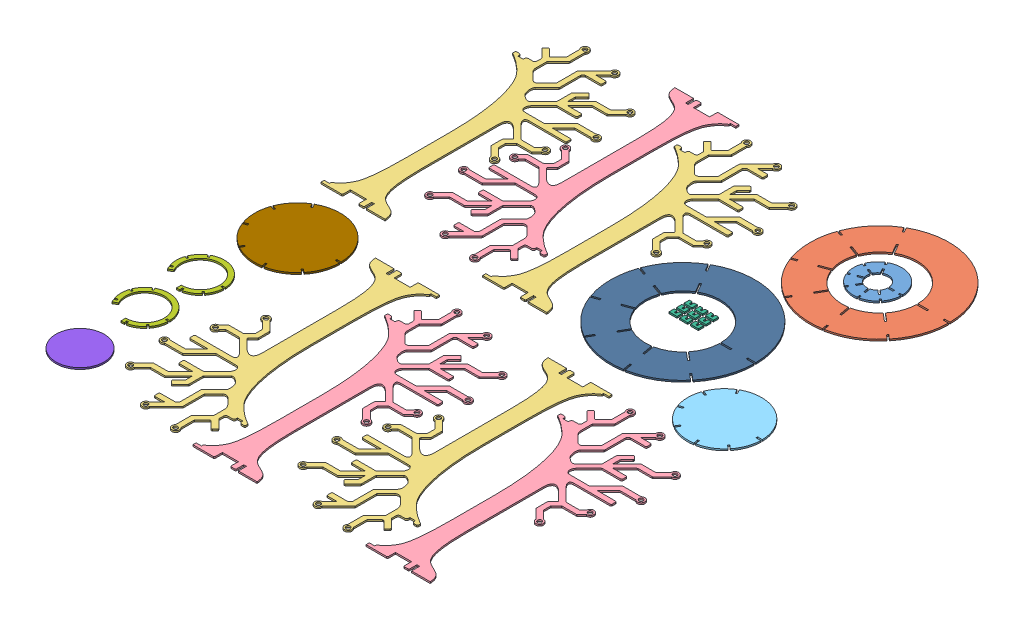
SolidWorks assembly TreePrint.SLDASM, configuration Default (file format 9000). Lengths in mm.
Overall size (4297.09 15 5172.67).
24 component instances, 10 part files, 23 mates.
Components (placement in the parent):
- Tree-Ring-1: Tree-Ring.SLDPRT [Default] at (2145.2995 -381.7094 -2028.0144) size (449.87 15 450)
- Tree-Base-2: Tree-Base.SLDPRT [Default] at (2163.4984 -381.7094 -2029.0173) size (1299.96 15 1300)
- Tree-2: Tree.SLDPRT [Default] at (-1210.2594 -381.7094 -230.2808) size (1107.13 15 2342.63)
- Tree-3: Tree.SLDPRT [Default] at (157.6022 -381.7094 129.1013) x (-1 0 0) z (0 0 -1) size (1107.13 15 2342.63)
- Tree-4: Tree.SLDPRT [Default] at (300.8259 -381.7094 -230.2808) size (1107.13 15 2342.63)
- Tree-5: Tree.SLDPRT [Default] at (1770.7727 -381.7094 129.1013) x (-1 0 0) z (0 0 -1) size (1107.13 15 2342.63)
- Tree-2-1: Tree-2.SLDPRT [Default] at (316.5667 -381.7094 2493.6575) size (1107.13 15 2342.63)
- Tree-2-2: Tree-2.SLDPRT [Default] at (1935.0611 -381.7094 2493.6575) size (1107.13 15 2342.63)
- Tree-2-3: Tree-2.SLDPRT [Default] at (177.69 -381.7094 -2649.5045) x (-1 0 0) z (0 0 -1) size (1107.13 15 2342.63)
- Tree-Base-TopLayer-1: Tree-Base-TopLayer.SLDPRT [Default] at (2541.912 -381.7094 -201.321) size (689.92 15 690)
- Spessore-Test-1: Spessore-Test.SLDPRT [Default] at (1415.8304 -381.7094 -806.9931) size (75 15 50)
- Spessore-Test-2: Spessore-Test.SLDPRT [Default] at (1415.8304 -381.7094 -876.9931) size (75 15 50)
- Spessore-Test-3: Spessore-Test.SLDPRT [Default] at (1515.8304 -381.7094 -806.9931) size (75 15 50)
- Spessore-Test-4: Spessore-Test.SLDPRT [Default] at (1515.8304 -381.7094 -876.9931) size (75 15 50)
- Spessore-Test-5: Spessore-Test.SLDPRT [Default] at (1615.8304 -381.7094 -806.9931) size (75 15 50)
- Spessore-Test-6: Spessore-Test.SLDPRT [Default] at (1615.8304 -381.7094 -876.9931) size (75 15 50)
- Spessore-Test-11: Spessore-Test.SLDPRT [Default] at (1415.8304 -381.7094 -946.9931) size (75 15 50)
- Spessore-Test-12: Spessore-Test.SLDPRT [Default] at (1515.8304 -381.7094 -946.9931) size (75 15 50)
- Spessore-Test-13: Spessore-Test.SLDPRT [Default] at (1615.8304 -381.7094 -946.9931) size (75 15 50)
- Tree-Ring-Layer1-1: Tree-Ring-Layer1.SLDPRT [Default] at (-1072.6547 -381.7094 1603.0356) size (449.87 15 450)
- Tree-Ring-Layer1-2: Tree-Ring-Layer1.SLDPRT [Default] at (-1079.963 -381.7094 1076.8425) size (449.87 15 450)
- Tree-Ring-Layer2-1: Tree-Ring-Layer2.SLDPRT [Default] at (-1043.4843 -381.7094 2238.8522) size (450 15 450)
- Tree-Base-TopLayer-Extended-1: Tree-Base-TopLayer-Extended.SLDPRT [Default] at (-919.9753 -381.7094 329.3469) size (799.93 15 800)
- Tree-Base-Extended-1: Tree-Base-Extended.SLDPRT [Default] at (1558.2691 -381.7094 -794.0663) size (1349.96 15 1350)
Mates (geometry in assembly coordinates):
- Coincident1: coincident aligned: plane of Tree-3 through (157.6022 -366.7094 129.1013) normal (0 1 0); plane of Tree-2 through (-1210.2594 -366.7094 -230.2808) normal (0 1 0)
- Coincident2: coincident aligned: plane of Tree-3 through (157.6022 -366.7094 129.1013) normal (0 1 0); plane of Tree-4 through (300.8259 -366.7094 -230.2808) normal (0 1 0)
- Coincident3: coincident aligned: plane of Tree-3 through (157.6022 -366.7094 129.1013) normal (0 1 0); plane of Tree-5 through (1770.7727 -366.7094 129.1013) normal (0 1 0)
- Coincident4: coincident aligned: plane of Tree-3 through (157.6022 -366.7094 129.1013) normal (0 1 0); plane of Tree-Base-2 through (2163.4984 -366.7094 -2029.0173) normal (0 1 0)
- Coincident5: coincident aligned: plane of Tree-3 through (157.6022 -366.7094 129.1013) normal (0 1 0); plane of Tree-Ring-1 through (2145.2995 -366.7094 -2028.0144) normal (0 1 0)
- Coincident7: coincident aligned: line of Tree-3 through (207.6022 -366.7094 129.1013) axis (-1 0 0); line of Tree-5 through (1820.7727 -366.7094 129.1013) axis (-1 0 0)
- Parallel2: parallel anti-aligned: line of Tree-4 through (250.8259 -366.7094 -230.2808) axis (1 0 0); line of Tree-5 through (1820.7727 -366.7094 129.1013) axis (-1 0 0)
- Coincident9: coincident aligned: line of Tree-2 through (-1260.2594 -366.7094 -230.2808) axis (1 0 0); line of Tree-4 through (250.8259 -366.7094 -230.2808) axis (1 0 0)
- Parallel3: parallel aligned: line of Tree-Base-2 through (2763.4984 -366.7094 -2021.5173) axis (1 0 0); line of Tree-2 through (-1260.2594 -366.7094 -230.2808) axis (1 0 0)
- Parallel4: parallel aligned: line of Tree-Ring-1 through (2345.2995 -366.7094 -2020.5144) axis (1 0 0); line of Tree-2 through (-1260.2594 -366.7094 -230.2808) axis (1 0 0)
- Coincident11: coincident aligned: plane of Tree-Ring-1 through (2145.2995 -366.7094 -2028.0144) normal (0 1 0); plane of Tree-2-1 through (316.5667 -366.7094 2493.6575) normal (0 1 0)
- Parallel6: parallel anti-aligned: plane of Tree-Base-2 through (2763.4984 -381.7094 -2021.5173) normal (0 0 -1); plane of Tree-2-1 through (316.5667 -366.7094 2418.6575) normal (0 0 1)
- Coincident14: coincident aligned: plane of Tree-2-1 through (316.5667 -366.7094 2493.6575) normal (0 1 0); plane of Tree-2-2 through (1935.0611 -366.7094 2493.6575) normal (0 1 0)
- Coincident15: coincident aligned: plane of Tree-2-1 through (316.5667 -366.7094 2418.6575) normal (0 0 1); plane of Tree-2-2 through (1935.0611 -366.7094 2418.6575) normal (0 0 1)
- Coincident16: coincident aligned: plane of Tree-2-2 through (1935.0611 -366.7094 2493.6575) normal (0 1 0); plane of Tree-2-3 through (177.69 -366.7094 -2649.5045) normal (0 1 0)
- Parallel7: parallel aligned: plane of Tree-Base-2 through (2763.4984 -381.7094 -2021.5173) normal (0 0 -1); plane of Tree-2-3 through (177.69 -366.7094 -2649.5045) normal (0 0 -1)
- Coincident17: coincident aligned: plane of Tree-Base-2 through (2163.4984 -381.7094 -2029.0173) normal (0 -1 0); plane of Tree-Base-TopLayer-1 through (2541.912 -381.7094 -201.321) normal (0 -1 0)
- Coincident21: coincident aligned: plane of Tree-2 through (-1210.2594 -366.7094 -230.2808) normal (0 1 0); plane of Tree-Base-TopLayer-Extended-1 through (-919.9753 -366.7094 329.3469) normal (0 1 0)
- Coincident22: coincident aligned: plane of Tree-Ring-Layer2-1 through (-1043.4843 -366.7094 2238.8522) normal (0 1 0); plane of Tree-Base-TopLayer-Extended-1 through (-919.9753 -366.7094 329.3469) normal (0 1 0)
- Coincident23: coincident aligned: plane of Tree-Ring-Layer1-1 through (-1072.6547 -366.7094 1603.0356) normal (0 1 0); plane of Tree-Base-TopLayer-Extended-1 through (-919.9753 -366.7094 329.3469) normal (0 1 0)
- Coincident24: coincident aligned: plane of Tree-Ring-Layer1-2 through (-1079.963 -366.7094 1076.8425) normal (0 1 0); plane of Tree-Base-TopLayer-Extended-1 through (-919.9753 -366.7094 329.3469) normal (0 1 0)
- Coincident25: coincident aligned: plane of Tree-Base-TopLayer-Extended-1 through (-919.9753 -366.7094 329.3469) normal (0 1 0); plane of Tree-Base-Extended-1 through (1558.2691 -366.7094 -794.0663) normal (0 1 0)
- Coincident26: coincident aligned: plane of Spessore-Test-11 through (1435.8304 -366.7094 -986.9931) normal (0 1 0); plane of Tree-Base-Extended-1 through (1558.2691 -366.7094 -794.0663) normal (0 1 0)
